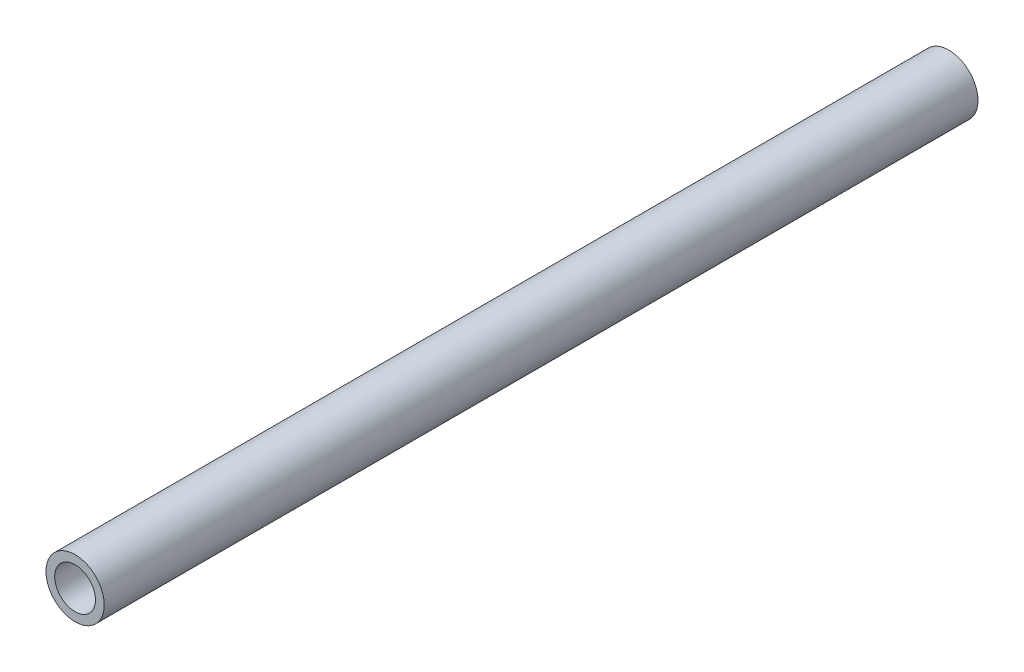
from build123d import *

# Parameters (mm, degrees)
SKIZZE1_R               = 10
SKIZZE1_R_2             = 7
LINEAR_AUSTRAGEN1_DEPTH = 300


with BuildPart() as part:
    # Skizze1 → Linear austragen1 (new body)
    with BuildSketch(Plane.XY):
        Circle(SKIZZE1_R)
        Circle(SKIZZE1_R_2, mode=Mode.SUBTRACT)
    extrude(amount=LINEAR_AUSTRAGEN1_DEPTH)


solid = part.part
